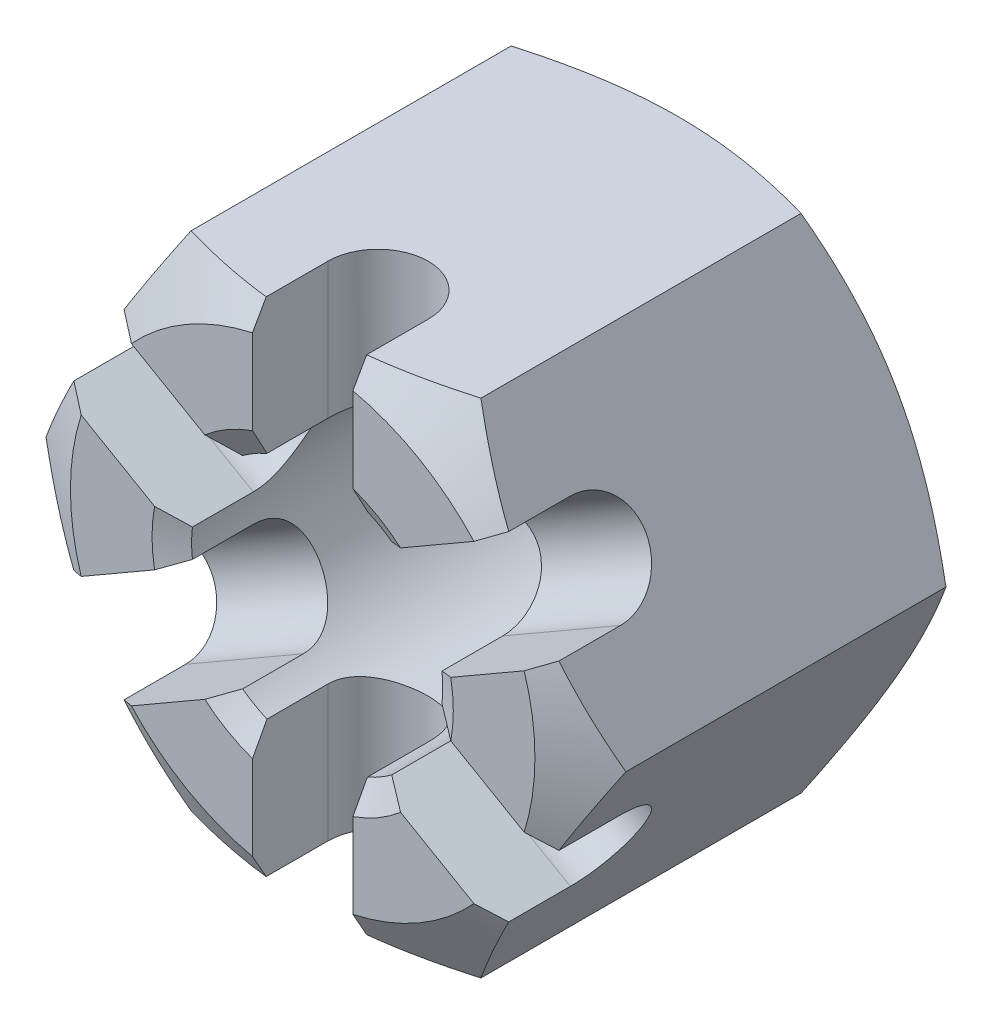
from build123d import *
from OCP.BRepFilletAPI import BRepFilletAPI_MakeChamfer

# Parameters (mm, degrees)
SKETCH1_R         = 2.5
BASENUT_DEPTH     = 7.7
ENDCHAMFER_SIZE   = 0.5
ENDCHAMFER_SIZE2  = 0.288675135
SLOT_DEPTH        = 11.845429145
SLOTPATTERN_COUNT = 3


with BuildPart() as part:
    # Sketch1 → BaseNut (new body)
    with BuildSketch(Plane.XY):
        Polygon((2.886751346, -5), (5.773502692, 0), (2.886751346, 5), (-2.886751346, 5), (-5.773502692, 0), (-2.886751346, -5), align=None)
        Circle(SKETCH1_R, mode=Mode.SUBTRACT)
    extrude(amount=-BASENUT_DEPTH)

    # Sketch2 → Double-Chamfer (revolve, cut)
    with BuildSketch(Plane(origin=(0, 0, 0), x_dir=(1, 0, 0), z_dir=(0, 1, 0))):
        Polygon((-5.773502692, 7.7), (-4.625, 7.7), (-5.773502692, 7.036911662), align=None)
        Polygon((-5.773502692, 0.663088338), (-5.773502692, 0), (-4.625, 0), align=None)
    revolve(axis=Axis((0, 0, -3.375940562), (0, 0, 1)), mode=Mode.SUBTRACT)

    # EndChamfer: one chamfer whose edges measure the first distance from different faces: ONE call of the kernel's chamfer builder (chamfer() names one face for all edges)
    endchamfer_edges_1 = [part.edges().sort_by_distance(p)[0] for p in [
        (-2.5, 0, -7.7),
    ]]
    endchamfer_side_1 = [part.faces().sort_by_distance(p)[0] for p in [
        (-2.5, 0, -3.85),
    ]]
    endchamfer_edges_2 = [part.edges().sort_by_distance(p)[0] for p in [
        (-2.5, 0, 0),
    ]]
    endchamfer_side_2 = [part.faces().sort_by_distance(p)[0] for p in [
        (4.494185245, 0, 0),
    ]]
    endchamfer = BRepFilletAPI_MakeChamfer(part.part.solid().wrapped)
    for e in endchamfer_edges_1:
        endchamfer.Add(ENDCHAMFER_SIZE, ENDCHAMFER_SIZE2, e.wrapped, endchamfer_side_1[0].wrapped)  # the first distance lies on this face
    for e in endchamfer_edges_2:
        endchamfer.Add(ENDCHAMFER_SIZE, ENDCHAMFER_SIZE2, e.wrapped, endchamfer_side_2[0].wrapped)  # the first distance lies on this face
    add(Compound.cast(endchamfer.Shape()), mode=Mode.REPLACE)

    # Sketch3 → Slot (cut, symmetric)
    with BuildSketch(Plane(origin=(0, 0, 0), x_dir=(1, 0, 0), z_dir=(0, 1, 0))):
        with BuildLine():
            Line((-1, -30.510518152), (-1, 0))
            Line((-1, 0), (-1, 1.5))
            ThreePointArc((-1, 1.5), (0, 2.5), (1, 1.5))
            Line((1, 1.5), (1, 0))
            Line((1, 0), (1, -30.510518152))
            Line((1, -30.510518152), (1, -91.531554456))
            Line((1, -91.531554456), (-1, -91.531554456))
            Line((-1, -91.531554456), (-1, -30.510518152))
        make_face()
    slot = extrude(amount=SLOT_DEPTH, both=True, mode=Mode.SUBTRACT)

    # SlotPattern: Slot ×3 about axis
    slotpattern_axis = Axis((0, 0, -3.375940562), (0, 0, 1))
    for i in range(1, SLOTPATTERN_COUNT):
        add(slot.rotate(slotpattern_axis, i * 360 / SLOTPATTERN_COUNT), mode=Mode.SUBTRACT)


solid = part.part
